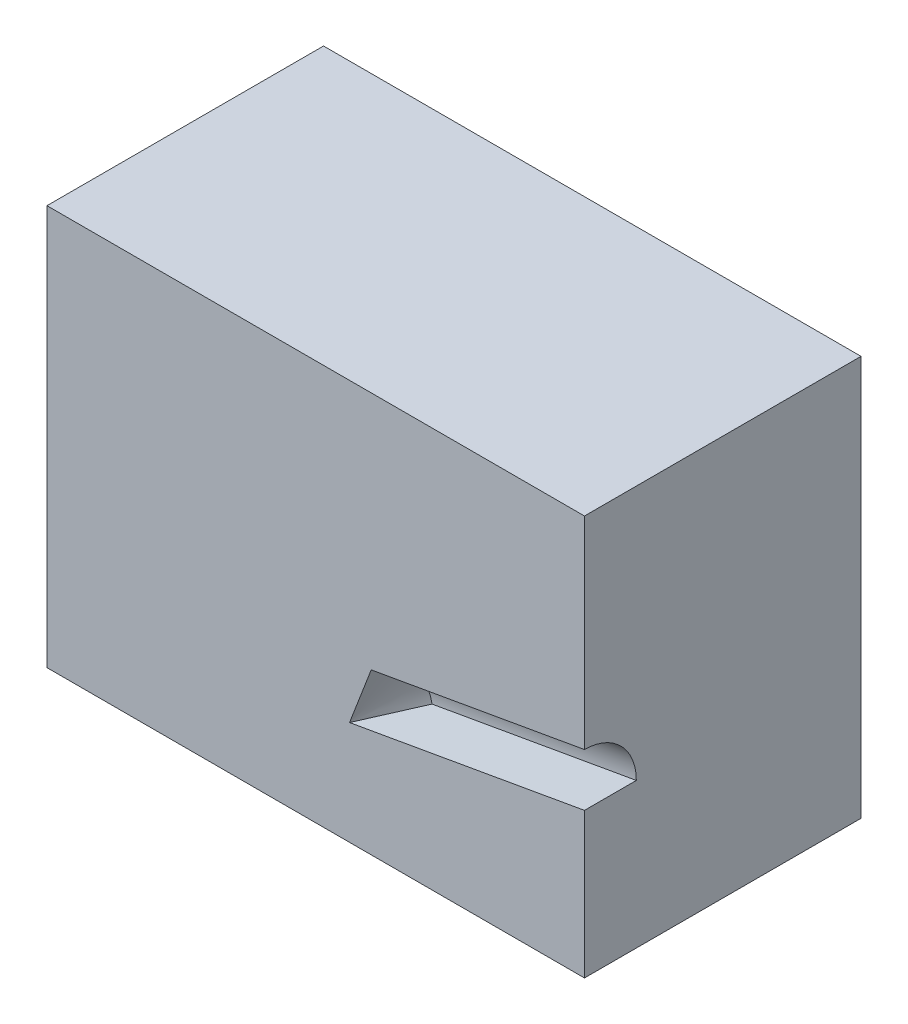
from build123d import *

# Parameters (mm, degrees)
SKIZZE1_W               = 77.745033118
SKIZZE1_H               = 57.873634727
LINEAR_AUSTRAGEN1_DEPTH = 40
SCHNITT_ROTATION1_ANGLE = 90


with BuildPart() as part:
    # Skizze1 → Linear austragen1 (new body)
    with BuildSketch(Plane.XY):
        with Locations((-38.872516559, 28.936817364)):
            Rectangle(SKIZZE1_W, SKIZZE1_H)
    extrude(amount=-LINEAR_AUSTRAGEN1_DEPTH)

    # Skizze2 → Schnitt-Rotation1 (revolve, cut)
    with BuildSketch(Plane.XY):
        Polygon((-30.846593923, 23.176612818), (32.679862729, 34.378041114), (33.982224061, 26.991982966), (-33.982224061, 15.008017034), align=None)
    revolve(axis=Axis((-33.982224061, 15.008017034, 0), (-0.9848077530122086, -0.17364817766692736, 0)), revolution_arc=SCHNITT_ROTATION1_ANGLE, mode=Mode.SUBTRACT)


solid = part.part
